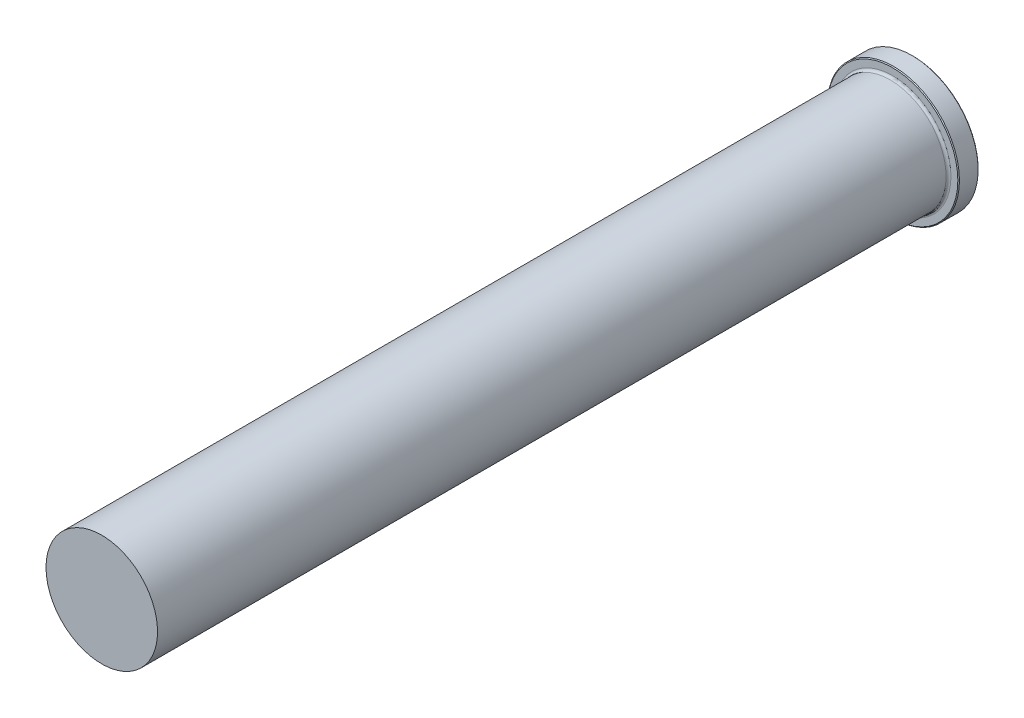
from build123d import *

# Parameters (mm, degrees)
FILLET1_R     = 0.762
CHAMFER1_SIZE = 0.254


with BuildPart() as part:
    # Sketch1 → Revolve1 (revolve)
    with BuildSketch(Plane(origin=(0, 0, 0), x_dir=(0, 0, -1), z_dir=(1, 0, 0)), mode=Mode.PRIVATE) as revolve1_sk:
        Polygon((0, 0), (0, 20.6375), (-6.35, 20.6375), (-6.35, 17.4625), (-254, 17.4625), (-254, 0), align=None)
    revolve(revolve1_sk.sketch.rotate(Axis((0, 0, 0), (0, 0, 1)), 90), axis=Axis((0, 0, 0), (0, 0, 1)))

    # Fillet1
    fillet1_edges = [part.edges().sort_by_distance(p)[0] for p in [
        (17.4625, 0, 6.35),
    ]]
    fillet(fillet1_edges, radius=FILLET1_R)

    # Chamfer1
    chamfer1_edges = [part.edges().sort_by_distance(p)[0] for p in [
        (20.6375, 0, 6.35),
        (20.6375, 0, 0),
    ]]
    chamfer(chamfer1_edges, length=CHAMFER1_SIZE)


solid = part.part
